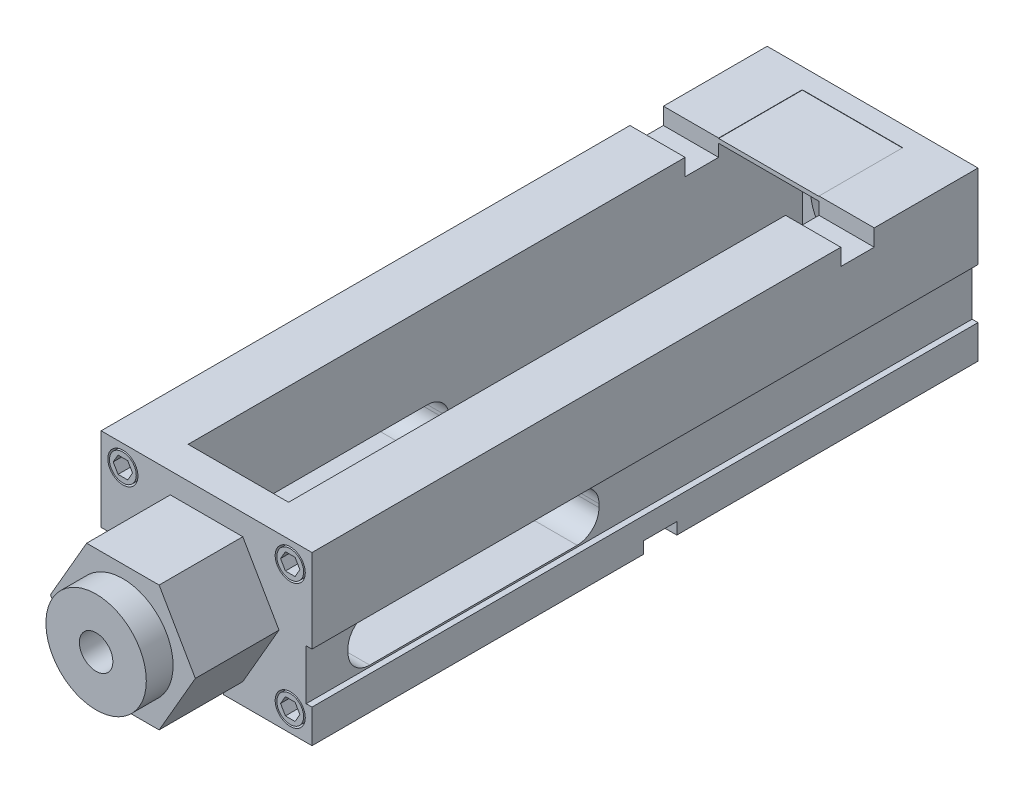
from build123d import *

# Parameters (mm, degrees)
SKIZZE1_W                        = 126
SKIZZE1_H                        = 100
BASIS_LINEAR_AUSTRAGEN_DEPTH     = 398
SKIZZE2_W                        = 20
SKIZZE2_H                        = 7.5
SKIZZE2_W_2                      = 3.5
SKIZZE2_H_2                      = 30
SCHNITT_LINEAR_AUSTRAGEN1_DEPTH  = 431.727642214
SKIZZE3_W                        = 150
SKIZZE3_H                        = 28
SCHNITT_LINEAR_AUSTRAGEN2_DEPTH  = 430.110870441
VERRUNDUNG4_R                    = 13
SKIZZE4_W                        = 20
SKIZZE4_H                        = 7
SKIZZE4_H_2                      = 10
SCHNITT_LINEAR_AUSTRAGEN3_DEPTH  = 430.278464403
SKIZZE5_W                        = 60
SKIZZE5_H                        = 80
SCHNITT_LINEAR_AUSTRAGEN4_DEPTH  = 367
AUFSATZ_LINEAR_AUSTRAGEN1_DEPTH  = 50
SKIZZE12_R                       = 30
AUFSATZ_LINEAR_AUSTRAGEN2_DEPTH  = 16
SKIZZE15_R                       = 9
SKIZZE15_R_2                     = 8
SCHNITT_LINEAR_AUSTRAGEN7_DEPTH  = 12
SCHNITT_LINEAR_AUSTRAGEN8_DEPTH  = 7
SCHNITT_LINEAR_START             = -12
SKIZZE17_R                       = 9
SKIZZE17_R_2                     = 8
SCHNITT_LINEAR_AUSTRAGEN9_DEPTH  = 12
SCHNITT_LINEAR_AUSTRAGEN10_DEPTH = 10
SKIZZE21_R                       = 20
SCHNITT_LINEAR_AUSTRAGEN11_DEPTH = 25
SKIZZE22_R                       = 25
SCHNITT_LINEAR_AUSTRAGEN12_DEPTH = 5
SKIZZE24_R                       = 10
SCHNITT_LINEAR_AUSTRAGEN13_DEPTH = 73
SKIZZE26_W                       = 60
SKIZZE26_H                       = 2.5
AUFSATZ_LINEAR_AUSTRAGEN3_DEPTH  = 50


with BuildPart() as part:
    # Skizze1 → Basis-Linear austragen (new body)
    with BuildSketch(Plane(origin=(2.048477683, 3.565868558, 0), x_dir=(1, 0, 0), z_dir=(0, 0, 1))):
        with Locations((63, 50)):
            Rectangle(SKIZZE1_W, SKIZZE1_H)
    extrude(amount=-BASIS_LINEAR_AUSTRAGEN_DEPTH)

    # Skizze2 → Schnitt-Linear austragen1 (cut, through all)
    with BuildSketch(Plane.XY):
        with Locations((65.048477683, 7.315868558)):
            Rectangle(SKIZZE2_W, SKIZZE2_H)
        with Locations((126.298477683, 38.565868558)):
            Rectangle(SKIZZE2_W_2, SKIZZE2_H_2)
        with Locations((3.798477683, 38.565868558)):
            Rectangle(SKIZZE2_W_2, SKIZZE2_H_2)
    extrude(amount=-SCHNITT_LINEAR_AUSTRAGEN1_DEPTH, mode=Mode.SUBTRACT)

    # Skizze3 → Schnitt-Linear austragen2 (cut, through all)
    with BuildSketch(Plane.ZY.offset(-5.548477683)):
        with Locations((-100, 38.565868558)):
            Rectangle(SKIZZE3_W, SKIZZE3_H)
    extrude(amount=-SCHNITT_LINEAR_AUSTRAGEN2_DEPTH, mode=Mode.SUBTRACT)

    # Verrundung4
    verrundung4_edges = [part.edges().sort_by_distance(p)[0] for p in [
        (65.048477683, 24.565868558, -175),
        (65.048477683, 52.565868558, -175),
        (65.048477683, 52.565868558, -25),
        (65.048477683, 24.565868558, -25),
    ]]
    fillet(verrundung4_edges, radius=VERRUNDUNG4_R)

    # Skizze4 → Schnitt-Linear austragen3 (cut, through all)
    with BuildSketch(Plane(origin=(2.048477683, 3.565868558, 0), x_dir=(0, 0, 1), z_dir=(-1, 0, 0))):
        with Locations((-208, 3.5)):
            Rectangle(SKIZZE4_W, SKIZZE4_H)
        with Locations((-326, 95)):
            Rectangle(SKIZZE4_W, SKIZZE4_H_2)
    extrude(amount=-SCHNITT_LINEAR_AUSTRAGEN3_DEPTH, mode=Mode.SUBTRACT)

    # Skizze5 → Schnitt-Linear austragen4 (cut)
    with BuildSketch(Plane.XY.offset(-19)):
        with Locations((65.048477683, 63.565868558)):
            Rectangle(SKIZZE5_W, SKIZZE5_H)
    extrude(amount=-SCHNITT_LINEAR_AUSTRAGEN4_DEPTH, mode=Mode.SUBTRACT)

    # Skizze11 → Aufsatz-Linear austragen1 (add)
    with BuildSketch(Plane.XY):
        Polygon((21.747207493, 53.565868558), (43.397842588, 16.065868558), (86.699112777, 16.065868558), (108.349747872, 53.565868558), (86.699112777, 91.065868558), (43.397842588, 91.065868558), align=None)
    extrude(amount=AUFSATZ_LINEAR_AUSTRAGEN1_DEPTH)

    # Skizze12 → Aufsatz-Linear austragen2 (add)
    with BuildSketch(Plane.XY.offset(50)):
        with Locations((65.048477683, 53.565868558)):
            Circle(SKIZZE12_R)
    extrude(amount=AUFSATZ_LINEAR_AUSTRAGEN2_DEPTH)

    # Skizze15 → Schnitt-Linear austragen7 (cut)
    # profile 1 of 4: a face of its own
    with BuildSketch(Plane(origin=(0, 0, -398), x_dir=(-1, 0, 0), z_dir=(0, 0, -1))):
        with Locations((-15.048477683, 16.065868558)):
            Circle(SKIZZE15_R)
        with Locations((-15.048477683, 16.065868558)):
            Circle(SKIZZE15_R_2, mode=Mode.SUBTRACT)
    # profile 2 of 4: a face of its own
    with BuildSketch(Plane(origin=(0, 0, -398), x_dir=(-1, 0, 0), z_dir=(0, 0, -1))):
        with Locations((-15.048477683, 91.065868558)):
            Circle(SKIZZE15_R)
        with Locations((-15.048477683, 91.065868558)):
            Circle(SKIZZE15_R_2, mode=Mode.SUBTRACT)
    # profile 3 of 4: a face of its own
    with BuildSketch(Plane(origin=(0, 0, -398), x_dir=(-1, 0, 0), z_dir=(0, 0, -1))):
        with Locations((-115.048477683, 91.065868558)):
            Circle(SKIZZE15_R)
        with Locations((-115.048477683, 91.065868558)):
            Circle(SKIZZE15_R_2, mode=Mode.SUBTRACT)
    # profile 4 of 4: a face of its own
    with BuildSketch(Plane(origin=(0, 0, -398), x_dir=(-1, 0, 0), z_dir=(0, 0, -1))):
        with Locations((-115.048477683, 16.065868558)):
            Circle(SKIZZE15_R)
        with Locations((-115.048477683, 16.065868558)):
            Circle(SKIZZE15_R_2, mode=Mode.SUBTRACT)
    extrude(amount=-SCHNITT_LINEAR_AUSTRAGEN7_DEPTH, mode=Mode.SUBTRACT)

    # Skizze16 → Schnitt-Linear austragen8 (cut)
    with BuildSketch(Plane(origin=(0, 0, -398), x_dir=(-1, 0, 0), z_dir=(0, 0, -1))):
        Polygon((-109.274974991, 91.065868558), (-112.161726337, 96.065868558), (-117.935229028, 96.065868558), (-120.821980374, 91.065868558), (-117.935229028, 86.065868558), (-112.161726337, 86.065868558), align=None)
        Polygon((-12.161726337, 86.065868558), (-9.274974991, 91.065868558), (-12.161726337, 96.065868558), (-17.935229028, 96.065868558), (-20.821980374, 91.065868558), (-17.935229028, 86.065868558), align=None)
        Polygon((-12.161726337, 11.065868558), (-9.274974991, 16.065868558), (-12.161726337, 21.065868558), (-17.935229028, 21.065868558), (-20.821980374, 16.065868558), (-17.935229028, 11.065868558), align=None)
        Polygon((-109.274974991, 16.065868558), (-112.161726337, 21.065868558), (-117.935229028, 21.065868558), (-120.821980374, 16.065868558), (-117.935229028, 11.065868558), (-112.161726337, 11.065868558), align=None)
    extrude(amount=-SCHNITT_LINEAR_AUSTRAGEN8_DEPTH, mode=Mode.SUBTRACT)

    # Skizze17 → Schnitt-Linear austragen9 (cut)
    # profile 1 of 4: a face of its own
    with BuildSketch(Plane.XY.offset(SCHNITT_LINEAR_START)):
        with Locations(Location((115.048477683, 16.065868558, 0), (0, 0, 180))):
            Circle(SKIZZE17_R)
        with Locations(Location((115.048477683, 16.065868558, 0), (0, 0, 180))):
            Circle(SKIZZE17_R_2, mode=Mode.SUBTRACT)
    # profile 2 of 4: a face of its own
    with BuildSketch(Plane.XY.offset(SCHNITT_LINEAR_START)):
        with Locations(Location((115.048477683, 91.065868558, 0), (0, 0, 180))):
            Circle(SKIZZE17_R)
        with Locations(Location((115.048477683, 91.065868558, 0), (0, 0, 180))):
            Circle(SKIZZE17_R_2, mode=Mode.SUBTRACT)
    # profile 3 of 4: a face of its own
    with BuildSketch(Plane.XY.offset(SCHNITT_LINEAR_START)):
        with Locations(Location((15.048477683, 91.065868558, 0), (0, 0, 180))):
            Circle(SKIZZE17_R)
        with Locations(Location((15.048477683, 91.065868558, 0), (0, 0, 180))):
            Circle(SKIZZE17_R_2, mode=Mode.SUBTRACT)
    # profile 4 of 4: a face of its own
    with BuildSketch(Plane.XY.offset(SCHNITT_LINEAR_START)):
        with Locations(Location((15.048477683, 16.065868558, 0), (0, 0, 180))):
            Circle(SKIZZE17_R)
        with Locations(Location((15.048477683, 16.065868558, 0), (0, 0, 180))):
            Circle(SKIZZE17_R_2, mode=Mode.SUBTRACT)
    extrude(amount=SCHNITT_LINEAR_AUSTRAGEN9_DEPTH, mode=Mode.SUBTRACT)

    # Skizze18 → Schnitt-Linear austragen10 (cut)
    with BuildSketch(Plane.XY):
        Polygon((17.935229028, 86.065868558), (20.821980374, 91.065868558), (17.935229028, 96.065868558), (12.161726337, 96.065868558), (9.274974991, 91.065868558), (12.161726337, 86.065868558), align=None)
        Polygon((117.935229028, 86.065868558), (120.821980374, 91.065868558), (117.935229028, 96.065868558), (112.161726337, 96.065868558), (109.274974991, 91.065868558), (112.161726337, 86.065868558), align=None)
        Polygon((117.935229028, 11.065868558), (120.821980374, 16.065868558), (117.935229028, 21.065868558), (112.161726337, 21.065868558), (109.274974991, 16.065868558), (112.161726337, 11.065868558), align=None)
        Polygon((17.935229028, 11.065868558), (20.821980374, 16.065868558), (17.935229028, 21.065868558), (12.161726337, 21.065868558), (9.274974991, 16.065868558), (12.161726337, 11.065868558), align=None)
    extrude(amount=-SCHNITT_LINEAR_AUSTRAGEN10_DEPTH, mode=Mode.SUBTRACT)

    # Skizze21 → Schnitt-Linear austragen11 (cut)
    with BuildSketch(Plane(origin=(0, 0, -19), x_dir=(-1, 0, 0), z_dir=(0, 0, -1))):
        with Locations((-65.048477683, 53.565868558)):
            Circle(SKIZZE21_R)
    extrude(amount=-SCHNITT_LINEAR_AUSTRAGEN11_DEPTH, mode=Mode.SUBTRACT)

    # Skizze22 → Schnitt-Linear austragen12 (cut)
    with BuildSketch(Plane.XY.offset(-386)):
        with Locations((65.048477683, 53.565868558)):
            Circle(SKIZZE22_R)
    extrude(amount=-SCHNITT_LINEAR_AUSTRAGEN12_DEPTH, mode=Mode.SUBTRACT)

    # Skizze24 → Schnitt-Linear austragen13 (cut)
    with BuildSketch(Plane.XY.offset(66)):
        with Locations((65.048477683, 53.565868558)):
            Circle(SKIZZE24_R)
    extrude(amount=-SCHNITT_LINEAR_AUSTRAGEN13_DEPTH, mode=Mode.SUBTRACT)

    # Skizze26 → Aufsatz-Linear austragen3 (add)
    with BuildSketch(Plane.XY.offset(-386)):
        with Locations((65.048477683, 102.115868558)):
            Rectangle(SKIZZE26_W, SKIZZE26_H)
    extrude(amount=AUFSATZ_LINEAR_AUSTRAGEN3_DEPTH)


solid = part.part
